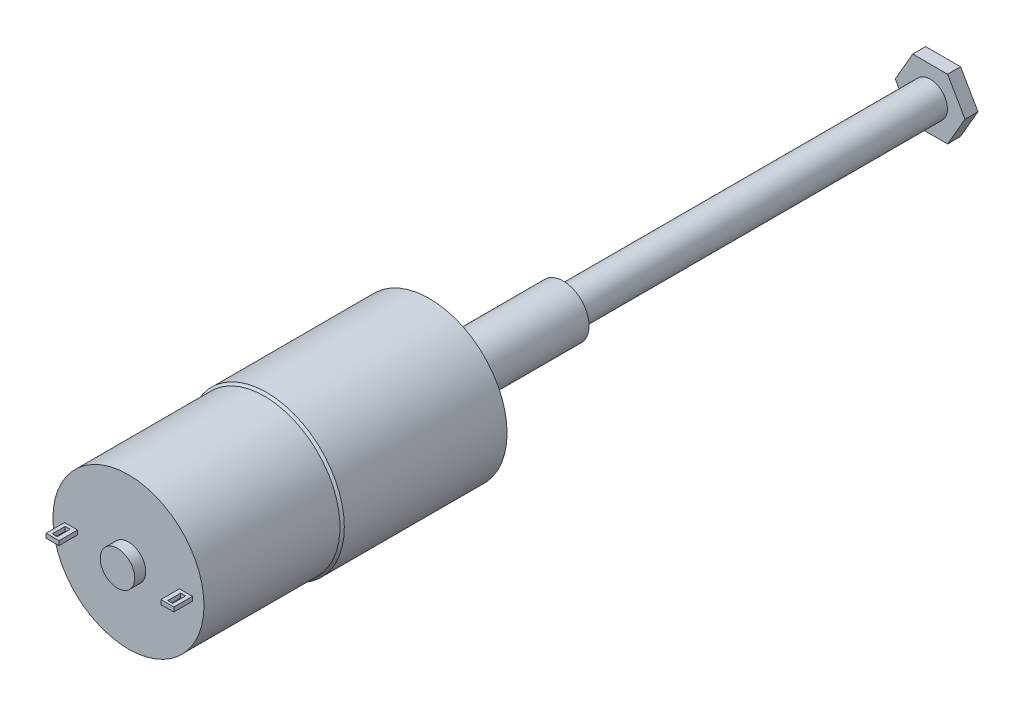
ISO-10303-21;
HEADER;
FILE_DESCRIPTION(('STEP AP214'),'2;1');
FILE_NAME('part.step','',(''),(''),'','','');
FILE_SCHEMA(('AUTOMOTIVE_DESIGN { 1 0 10303 214 1 1 1 1 }'));
ENDSEC;
DATA;
#1=APPLICATION_CONTEXT('core data for automotive mechanical design processes');
#2=APPLICATION_PROTOCOL_DEFINITION('international standard','automotive_design',2000,#1);
#3=PRODUCT_CONTEXT('',#1,'mechanical');
#4=PRODUCT('Part','Part','',(#3));
#5=PRODUCT_RELATED_PRODUCT_CATEGORY('part','',(#4));
#6=PRODUCT_DEFINITION_FORMATION('','',#4);
#7=PRODUCT_DEFINITION_CONTEXT('part definition',#1,'design');
#8=PRODUCT_DEFINITION('design','',#6,#7);
#9=PRODUCT_DEFINITION_SHAPE('','',#8);
#10=(LENGTH_UNIT() NAMED_UNIT(*) SI_UNIT(.MILLI.,.METRE.));
#11=(NAMED_UNIT(*) PLANE_ANGLE_UNIT() SI_UNIT($,.RADIAN.));
#12=(NAMED_UNIT(*) SI_UNIT($,.STERADIAN.) SOLID_ANGLE_UNIT());
#13=UNCERTAINTY_MEASURE_WITH_UNIT(LENGTH_MEASURE(1.E-05),#10,'distance_accuracy_value','');
#14=(GEOMETRIC_REPRESENTATION_CONTEXT(3) GLOBAL_UNCERTAINTY_ASSIGNED_CONTEXT((#13)) GLOBAL_UNIT_ASSIGNED_CONTEXT((#10,
#11,#12)) REPRESENTATION_CONTEXT('',''));
#15=CARTESIAN_POINT('',(0.,0.,0.));
#16=DIRECTION('',(0.,0.,1.));
#17=DIRECTION('',(1.,0.,0.));
#18=AXIS2_PLACEMENT_3D('',#15,#16,#17);
#19=CARTESIAN_POINT('',(0.,0.,-17.));
#20=DIRECTION('',(0.,0.,1.));
#21=DIRECTION('',(1.,0.,0.));
#22=AXIS2_PLACEMENT_3D('',#19,#20,#21);
#23=CYLINDRICAL_SURFACE('',#22,4.);
#24=CARTESIAN_POINT('',(0.,0.,-2.));
#25=DIRECTION('',(0.,0.,-1.));
#26=DIRECTION('',(-1.,0.,0.));
#27=AXIS2_PLACEMENT_3D('',#24,#25,#26);
#28=CIRCLE('',#27,4.);
#29=CARTESIAN_POINT('',(-4.,0.,-2.));
#30=VERTEX_POINT('',#29);
#31=EDGE_CURVE('E453',#30,#30,#28,.T.);
#32=ORIENTED_EDGE('',*,*,#31,.T.);
#33=EDGE_LOOP('',(#32));
#34=FACE_BOUND('',#33,.T.);
#35=CARTESIAN_POINT('',(0.,0.,-7.));
#36=DIRECTION('',(0.,0.,-1.));
#37=DIRECTION('',(-1.,0.,0.));
#38=AXIS2_PLACEMENT_3D('',#35,#36,#37);
#39=CIRCLE('',#38,4.);
#40=CARTESIAN_POINT('',(2.64575131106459,3.,-7.));
#41=VERTEX_POINT('',#40);
#42=CARTESIAN_POINT('',(-2.64575131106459,3.,-7.));
#43=VERTEX_POINT('',#42);
#44=EDGE_CURVE('E264',#41,#43,#39,.T.);
#45=ORIENTED_EDGE('',*,*,#44,.F.);
#46=DIRECTION('',(0.,0.,-1.));
#47=VECTOR('',#46,1.);
#48=CARTESIAN_POINT('',(2.64575131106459,3.,-5.));
#49=LINE('',#48,#47);
#50=CARTESIAN_POINT('',(2.64575131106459,3.,-5.));
#51=VERTEX_POINT('',#50);
#52=EDGE_CURVE('E462',#51,#41,#49,.T.);
#53=ORIENTED_EDGE('',*,*,#52,.F.);
#54=CARTESIAN_POINT('',(0.,0.,-5.));
#55=DIRECTION('',(0.,0.,-1.));
#56=DIRECTION('',(-1.,0.,0.));
#57=AXIS2_PLACEMENT_3D('',#54,#55,#56);
#58=CIRCLE('',#57,4.);
#59=CARTESIAN_POINT('',(-2.64575131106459,3.,-5.));
#60=VERTEX_POINT('',#59);
#61=EDGE_CURVE('E457',#60,#51,#58,.T.);
#62=ORIENTED_EDGE('',*,*,#61,.F.);
#63=DIRECTION('',(0.,0.,-1.));
#64=VECTOR('',#63,1.);
#65=CARTESIAN_POINT('',(-2.64575131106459,3.,-5.));
#66=LINE('',#65,#64);
#67=EDGE_CURVE('E461',#60,#43,#66,.T.);
#68=ORIENTED_EDGE('',*,*,#67,.T.);
#69=EDGE_LOOP('',(#45,#53,#62,#68));
#70=FACE_BOUND('',#69,.T.);
#71=ADVANCED_FACE('F55',(#34,#70),#23,.T.);
#72=CARTESIAN_POINT('',(2.64575131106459,3.,-5.));
#73=DIRECTION('',(0.,-1.,0.));
#74=DIRECTION('',(0.,0.,-1.));
#75=AXIS2_PLACEMENT_3D('',#72,#73,#74);
#76=PLANE('',#75);
#77=DIRECTION('',(1.,0.,0.));
#78=VECTOR('',#77,1.);
#79=CARTESIAN_POINT('',(2.64575131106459,3.,-7.));
#80=LINE('',#79,#78);
#81=EDGE_CURVE('E60',#43,#41,#80,.T.);
#82=ORIENTED_EDGE('',*,*,#81,.F.);
#83=ORIENTED_EDGE('',*,*,#67,.F.);
#84=DIRECTION('',(-1.,0.,0.));
#85=VECTOR('',#84,1.);
#86=CARTESIAN_POINT('',(2.64575131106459,3.,-5.));
#87=LINE('',#86,#85);
#88=EDGE_CURVE('E448',#51,#60,#87,.T.);
#89=ORIENTED_EDGE('',*,*,#88,.F.);
#90=ORIENTED_EDGE('',*,*,#52,.T.);
#91=EDGE_LOOP('',(#82,#83,#89,#90));
#92=FACE_BOUND('',#91,.T.);
#93=ADVANCED_FACE('F513',(#92),#76,.F.);
#94=CARTESIAN_POINT('',(0.,0.,69.7));
#95=DIRECTION('',(0.,0.,1.));
#96=DIRECTION('',(1.,0.,0.));
#97=AXIS2_PLACEMENT_3D('',#94,#95,#96);
#98=PLANE('',#97);
#99=CARTESIAN_POINT('',(0.,0.,69.7));
#100=DIRECTION('',(0.,0.,1.));
#101=DIRECTION('',(1.,0.,0.));
#102=AXIS2_PLACEMENT_3D('',#99,#100,#101);
#103=CIRCLE('',#102,4.);
#104=CARTESIAN_POINT('',(4.,0.,69.7));
#105=VERTEX_POINT('',#104);
#106=EDGE_CURVE('E449',#105,#105,#103,.T.);
#107=ORIENTED_EDGE('',*,*,#106,.F.);
#108=EDGE_LOOP('',(#107));
#109=FACE_BOUND('',#108,.T.);
#110=CARTESIAN_POINT('',(0.,0.,69.7));
#111=DIRECTION('',(0.,0.,1.));
#112=DIRECTION('',(1.,0.,0.));
#113=AXIS2_PLACEMENT_3D('',#110,#111,#112);
#114=CIRCLE('',#113,17.5);
#115=CARTESIAN_POINT('',(17.5,0.,69.7));
#116=VERTEX_POINT('',#115);
#117=EDGE_CURVE('E475',#116,#116,#114,.T.);
#118=ORIENTED_EDGE('',*,*,#117,.T.);
#119=EDGE_LOOP('',(#118));
#120=FACE_BOUND('',#119,.T.);
#121=DIRECTION('',(1.,0.,0.));
#122=VECTOR('',#121,1.);
#123=CARTESIAN_POINT('',(-14.8,-0.499999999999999,69.7));
#124=LINE('',#123,#122);
#125=CARTESIAN_POINT('',(-14.8,-0.499999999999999,69.7));
#126=VERTEX_POINT('',#125);
#127=CARTESIAN_POINT('',(-11.8,-0.499999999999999,69.7));
#128=VERTEX_POINT('',#127);
#129=EDGE_CURVE('E425',#126,#128,#124,.T.);
#130=ORIENTED_EDGE('',*,*,#129,.F.);
#131=DIRECTION('',(0.,-1.,0.));
#132=VECTOR('',#131,1.);
#133=CARTESIAN_POINT('',(-14.8,0.500000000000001,69.7));
#134=LINE('',#133,#132);
#135=CARTESIAN_POINT('',(-14.8,0.500000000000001,69.7));
#136=VERTEX_POINT('',#135);
#137=EDGE_CURVE('E377',#136,#126,#134,.T.);
#138=ORIENTED_EDGE('',*,*,#137,.F.);
#139=DIRECTION('',(1.,0.,0.));
#140=VECTOR('',#139,1.);
#141=CARTESIAN_POINT('',(-14.8,0.500000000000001,69.7));
#142=LINE('',#141,#140);
#143=CARTESIAN_POINT('',(-11.8,0.500000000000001,69.7));
#144=VERTEX_POINT('',#143);
#145=EDGE_CURVE('E418',#136,#144,#142,.T.);
#146=ORIENTED_EDGE('',*,*,#145,.T.);
#147=DIRECTION('',(0.,-1.,0.));
#148=VECTOR('',#147,1.);
#149=CARTESIAN_POINT('',(-11.8,0.500000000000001,69.7));
#150=LINE('',#149,#148);
#151=EDGE_CURVE('E421',#144,#128,#150,.T.);
#152=ORIENTED_EDGE('',*,*,#151,.T.);
#153=EDGE_LOOP('',(#130,#138,#146,#152));
#154=FACE_BOUND('',#153,.T.);
#155=DIRECTION('',(1.,0.,0.));
#156=VECTOR('',#155,1.);
#157=CARTESIAN_POINT('',(11.8,-0.5,69.7));
#158=LINE('',#157,#156);
#159=CARTESIAN_POINT('',(11.8,-0.5,69.7));
#160=VERTEX_POINT('',#159);
#161=CARTESIAN_POINT('',(14.8,-0.5,69.7));
#162=VERTEX_POINT('',#161);
#163=EDGE_CURVE('E376',#160,#162,#158,.T.);
#164=ORIENTED_EDGE('',*,*,#163,.F.);
#165=DIRECTION('',(0.,-1.,0.));
#166=VECTOR('',#165,1.);
#167=CARTESIAN_POINT('',(11.8,0.5,69.7));
#168=LINE('',#167,#166);
#169=CARTESIAN_POINT('',(11.8,0.5,69.7));
#170=VERTEX_POINT('',#169);
#171=EDGE_CURVE('E372',#170,#160,#168,.T.);
#172=ORIENTED_EDGE('',*,*,#171,.F.);
#173=DIRECTION('',(1.,0.,0.));
#174=VECTOR('',#173,1.);
#175=CARTESIAN_POINT('',(11.8,0.5,69.7));
#176=LINE('',#175,#174);
#177=CARTESIAN_POINT('',(14.8,0.5,69.7));
#178=VERTEX_POINT('',#177);
#179=EDGE_CURVE('E360',#170,#178,#176,.T.);
#180=ORIENTED_EDGE('',*,*,#179,.T.);
#181=DIRECTION('',(0.,-1.,0.));
#182=VECTOR('',#181,1.);
#183=CARTESIAN_POINT('',(14.8,0.5,69.7));
#184=LINE('',#183,#182);
#185=EDGE_CURVE('E381',#178,#162,#184,.T.);
#186=ORIENTED_EDGE('',*,*,#185,.T.);
#187=EDGE_LOOP('',(#164,#172,#180,#186));
#188=FACE_BOUND('',#187,.T.);
#189=ADVANCED_FACE('F520',(#109,#120,#154,#188),#98,.T.);
#190=CARTESIAN_POINT('',(0.,0.,38.7));
#191=DIRECTION('',(0.,0.,-1.));
#192=DIRECTION('',(-1.,0.,0.));
#193=AXIS2_PLACEMENT_3D('',#190,#191,#192);
#194=CYLINDRICAL_SURFACE('',#193,18.);
#195=CARTESIAN_POINT('',(0.,0.,37.7));
#196=DIRECTION('',(0.,0.,1.));
#197=DIRECTION('',(1.,0.,0.));
#198=AXIS2_PLACEMENT_3D('',#195,#196,#197);
#199=CIRCLE('',#198,18.);
#200=CARTESIAN_POINT('',(18.,0.,37.7));
#201=VERTEX_POINT('',#200);
#202=EDGE_CURVE('E487',#201,#201,#199,.F.);
#203=ORIENTED_EDGE('',*,*,#202,.T.);
#204=EDGE_LOOP('',(#203));
#205=FACE_BOUND('',#204,.T.);
#206=CARTESIAN_POINT('',(0.,0.,0.));
#207=DIRECTION('',(0.,0.,1.));
#208=DIRECTION('',(1.,0.,0.));
#209=AXIS2_PLACEMENT_3D('',#206,#207,#208);
#210=CIRCLE('',#209,18.);
#211=CARTESIAN_POINT('',(18.,0.,0.));
#212=VERTEX_POINT('',#211);
#213=EDGE_CURVE('E483',#212,#212,#210,.T.);
#214=ORIENTED_EDGE('',*,*,#213,.T.);
#215=EDGE_LOOP('',(#214));
#216=FACE_BOUND('',#215,.T.);
#217=ADVANCED_FACE('F530',(#205,#216),#194,.T.);
#218=CARTESIAN_POINT('',(0.,0.,0.));
#219=DIRECTION('',(0.,0.,1.));
#220=DIRECTION('',(1.,0.,0.));
#221=AXIS2_PLACEMENT_3D('',#218,#219,#220);
#222=PLANE('',#221);
#223=CARTESIAN_POINT('',(0.,0.,0.));
#224=DIRECTION('',(0.,0.,-1.));
#225=DIRECTION('',(-1.,0.,0.));
#226=AXIS2_PLACEMENT_3D('',#223,#224,#225);
#227=CIRCLE('',#226,11.);
#228=CARTESIAN_POINT('',(-11.,0.,0.));
#229=VERTEX_POINT('',#228);
#230=EDGE_CURVE('E471',#229,#229,#227,.T.);
#231=ORIENTED_EDGE('',*,*,#230,.F.);
#232=EDGE_LOOP('',(#231));
#233=FACE_BOUND('',#232,.T.);
#234=ORIENTED_EDGE('',*,*,#213,.F.);
#235=EDGE_LOOP('',(#234));
#236=FACE_BOUND('',#235,.T.);
#237=ADVANCED_FACE('F509',(#233,#236),#222,.F.);
#238=CARTESIAN_POINT('',(0.,0.,69.7));
#239=DIRECTION('',(0.,0.,-1.));
#240=DIRECTION('',(-1.,0.,0.));
#241=AXIS2_PLACEMENT_3D('',#238,#239,#240);
#242=CYLINDRICAL_SURFACE('',#241,17.5);
#243=CARTESIAN_POINT('',(0.,0.,38.2));
#244=DIRECTION('',(0.,0.,-1.));
#245=DIRECTION('',(-1.,0.,0.));
#246=AXIS2_PLACEMENT_3D('',#243,#244,#245);
#247=CIRCLE('',#246,17.5);
#248=CARTESIAN_POINT('',(-17.5,0.,38.2));
#249=VERTEX_POINT('',#248);
#250=EDGE_CURVE('E479',#249,#249,#247,.F.);
#251=ORIENTED_EDGE('',*,*,#250,.T.);
#252=EDGE_LOOP('',(#251));
#253=FACE_BOUND('',#252,.T.);
#254=ORIENTED_EDGE('',*,*,#117,.F.);
#255=EDGE_LOOP('',(#254));
#256=FACE_BOUND('',#255,.T.);
#257=ADVANCED_FACE('F495',(#253,#256),#242,.T.);
#258=CARTESIAN_POINT('',(0.,0.,38.7));
#259=DIRECTION('',(0.,0.,-1.));
#260=DIRECTION('',(-1.,0.,0.));
#261=AXIS2_PLACEMENT_3D('',#258,#259,#260);
#262=CONICAL_SURFACE('',#261,17.,0.785398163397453);
#263=ORIENTED_EDGE('',*,*,#202,.F.);
#264=EDGE_LOOP('',(#263));
#265=FACE_BOUND('',#264,.T.);
#266=ORIENTED_EDGE('',*,*,#250,.F.);
#267=EDGE_LOOP('',(#266));
#268=FACE_BOUND('',#267,.T.);
#269=ADVANCED_FACE('F58',(#265,#268),#262,.T.);
#270=CARTESIAN_POINT('',(0.,0.,-2.));
#271=DIRECTION('',(0.,0.,1.));
#272=DIRECTION('',(1.,0.,0.));
#273=AXIS2_PLACEMENT_3D('',#270,#271,#272);
#274=CYLINDRICAL_SURFACE('',#273,11.);
#275=CARTESIAN_POINT('',(0.,0.,-2.));
#276=DIRECTION('',(0.,0.,-1.));
#277=DIRECTION('',(-1.,0.,0.));
#278=AXIS2_PLACEMENT_3D('',#275,#276,#277);
#279=CIRCLE('',#278,11.);
#280=CARTESIAN_POINT('',(-11.,0.,-2.));
#281=VERTEX_POINT('',#280);
#282=EDGE_CURVE('E465',#281,#281,#279,.T.);
#283=ORIENTED_EDGE('',*,*,#282,.F.);
#284=EDGE_LOOP('',(#283));
#285=FACE_BOUND('',#284,.T.);
#286=ORIENTED_EDGE('',*,*,#230,.T.);
#287=EDGE_LOOP('',(#286));
#288=FACE_BOUND('',#287,.T.);
#289=ADVANCED_FACE('F499',(#285,#288),#274,.T.);
#290=CARTESIAN_POINT('',(0.,0.,-2.));
#291=DIRECTION('',(0.,0.,-1.));
#292=DIRECTION('',(-1.,0.,0.));
#293=AXIS2_PLACEMENT_3D('',#290,#291,#292);
#294=PLANE('',#293);
#295=ORIENTED_EDGE('',*,*,#31,.F.);
#296=EDGE_LOOP('',(#295));
#297=FACE_BOUND('',#296,.T.);
#298=ORIENTED_EDGE('',*,*,#282,.T.);
#299=EDGE_LOOP('',(#298));
#300=FACE_BOUND('',#299,.T.);
#301=ADVANCED_FACE('F505',(#297,#300),#294,.T.);
#302=CARTESIAN_POINT('',(0.,0.,-5.));
#303=DIRECTION('',(0.,0.,-1.));
#304=DIRECTION('',(-1.,0.,0.));
#305=AXIS2_PLACEMENT_3D('',#302,#303,#304);
#306=PLANE('',#305);
#307=ORIENTED_EDGE('',*,*,#88,.T.);
#308=ORIENTED_EDGE('',*,*,#61,.T.);
#309=EDGE_LOOP('',(#307,#308));
#310=FACE_BOUND('',#309,.T.);
#311=ADVANCED_FACE('F526',(#310),#306,.T.);
#312=CARTESIAN_POINT('',(0.,0.,72.24));
#313=DIRECTION('',(0.,0.,-1.));
#314=DIRECTION('',(-1.,0.,0.));
#315=AXIS2_PLACEMENT_3D('',#312,#313,#314);
#316=CYLINDRICAL_SURFACE('',#315,4.);
#317=CARTESIAN_POINT('',(0.,0.,72.24));
#318=DIRECTION('',(0.,0.,1.));
#319=DIRECTION('',(1.,0.,0.));
#320=AXIS2_PLACEMENT_3D('',#317,#318,#319);
#321=CIRCLE('',#320,4.);
#322=CARTESIAN_POINT('',(4.,0.,72.24));
#323=VERTEX_POINT('',#322);
#324=EDGE_CURVE('E401',#323,#323,#321,.T.);
#325=ORIENTED_EDGE('',*,*,#324,.F.);
#326=EDGE_LOOP('',(#325));
#327=FACE_BOUND('',#326,.T.);
#328=ORIENTED_EDGE('',*,*,#106,.T.);
#329=EDGE_LOOP('',(#328));
#330=FACE_BOUND('',#329,.T.);
#331=ADVANCED_FACE('F898',(#327,#330),#316,.T.);
#332=CARTESIAN_POINT('',(0.,0.,72.24));
#333=DIRECTION('',(0.,0.,1.));
#334=DIRECTION('',(1.,0.,0.));
#335=AXIS2_PLACEMENT_3D('',#332,#333,#334);
#336=PLANE('',#335);
#337=ORIENTED_EDGE('',*,*,#324,.T.);
#338=EDGE_LOOP('',(#337));
#339=FACE_BOUND('',#338,.T.);
#340=ADVANCED_FACE('F566',(#339),#336,.T.);
#341=CARTESIAN_POINT('',(-14.8,0.500000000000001,74.));
#342=DIRECTION('',(1.,0.,0.));
#343=DIRECTION('',(0.,0.,-1.));
#344=AXIS2_PLACEMENT_3D('',#341,#342,#343);
#345=PLANE('',#344);
#346=ORIENTED_EDGE('',*,*,#137,.T.);
#347=DIRECTION('',(0.,0.,-1.));
#348=VECTOR('',#347,1.);
#349=CARTESIAN_POINT('',(-14.8,-0.499999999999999,74.));
#350=LINE('',#349,#348);
#351=CARTESIAN_POINT('',(-14.8,-0.499999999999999,74.));
#352=VERTEX_POINT('',#351);
#353=EDGE_CURVE('E354',#352,#126,#350,.T.);
#354=ORIENTED_EDGE('',*,*,#353,.F.);
#355=DIRECTION('',(0.,-1.,0.));
#356=VECTOR('',#355,1.);
#357=CARTESIAN_POINT('',(-14.8,0.500000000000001,74.));
#358=LINE('',#357,#356);
#359=CARTESIAN_POINT('',(-14.8,0.500000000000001,74.));
#360=VERTEX_POINT('',#359);
#361=EDGE_CURVE('E422',#360,#352,#358,.T.);
#362=ORIENTED_EDGE('',*,*,#361,.F.);
#363=DIRECTION('',(0.,0.,-1.));
#364=VECTOR('',#363,1.);
#365=CARTESIAN_POINT('',(-14.8,0.500000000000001,74.));
#366=LINE('',#365,#364);
#367=EDGE_CURVE('E413',#360,#136,#366,.T.);
#368=ORIENTED_EDGE('',*,*,#367,.T.);
#369=EDGE_LOOP('',(#346,#354,#362,#368));
#370=FACE_BOUND('',#369,.T.);
#371=ADVANCED_FACE('F562',(#370),#345,.F.);
#372=CARTESIAN_POINT('',(-14.8,-0.499999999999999,74.));
#373=DIRECTION('',(0.,1.,0.));
#374=DIRECTION('',(0.,0.,1.));
#375=AXIS2_PLACEMENT_3D('',#372,#373,#374);
#376=PLANE('',#375);
#377=DIRECTION('',(1.,0.,0.));
#378=VECTOR('',#377,1.);
#379=CARTESIAN_POINT('',(-14.8,-0.499999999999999,73.4));
#380=LINE('',#379,#378);
#381=CARTESIAN_POINT('',(-13.9628480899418,-0.5,73.4));
#382=VERTEX_POINT('',#381);
#383=CARTESIAN_POINT('',(-12.8,-0.5,73.4));
#384=VERTEX_POINT('',#383);
#385=EDGE_CURVE('E346',#382,#384,#380,.T.);
#386=ORIENTED_EDGE('',*,*,#385,.T.);
#387=DIRECTION('',(0.,0.,-1.));
#388=VECTOR('',#387,1.);
#389=CARTESIAN_POINT('',(-12.8,-0.499999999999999,74.));
#390=LINE('',#389,#388);
#391=CARTESIAN_POINT('',(-12.8,-0.5,70.4));
#392=VERTEX_POINT('',#391);
#393=EDGE_CURVE('E350',#384,#392,#390,.T.);
#394=ORIENTED_EDGE('',*,*,#393,.T.);
#395=DIRECTION('',(-1.,0.,0.));
#396=VECTOR('',#395,1.);
#397=CARTESIAN_POINT('',(-14.8,-0.499999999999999,70.4));
#398=LINE('',#397,#396);
#399=CARTESIAN_POINT('',(-13.9628480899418,-0.499999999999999,70.4));
#400=VERTEX_POINT('',#399);
#401=EDGE_CURVE('E338',#392,#400,#398,.T.);
#402=ORIENTED_EDGE('',*,*,#401,.T.);
#403=DIRECTION('',(0.,0.,1.));
#404=VECTOR('',#403,1.);
#405=CARTESIAN_POINT('',(-13.9628480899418,-0.499999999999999,74.));
#406=LINE('',#405,#404);
#407=EDGE_CURVE('E342',#400,#382,#406,.T.);
#408=ORIENTED_EDGE('',*,*,#407,.T.);
#409=EDGE_LOOP('',(#386,#394,#402,#408));
#410=FACE_BOUND('',#409,.T.);
#411=ORIENTED_EDGE('',*,*,#129,.T.);
#412=DIRECTION('',(0.,0.,-1.));
#413=VECTOR('',#412,1.);
#414=CARTESIAN_POINT('',(-11.8,-0.499999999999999,74.));
#415=LINE('',#414,#413);
#416=CARTESIAN_POINT('',(-11.8,-0.499999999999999,74.));
#417=VERTEX_POINT('',#416);
#418=EDGE_CURVE('E405',#417,#128,#415,.T.);
#419=ORIENTED_EDGE('',*,*,#418,.F.);
#420=DIRECTION('',(1.,0.,0.));
#421=VECTOR('',#420,1.);
#422=CARTESIAN_POINT('',(-14.8,-0.499999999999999,74.));
#423=LINE('',#422,#421);
#424=EDGE_CURVE('E439',#352,#417,#423,.T.);
#425=ORIENTED_EDGE('',*,*,#424,.F.);
#426=ORIENTED_EDGE('',*,*,#353,.T.);
#427=EDGE_LOOP('',(#411,#419,#425,#426));
#428=FACE_BOUND('',#427,.T.);
#429=ADVANCED_FACE('F565',(#410,#428),#376,.F.);
#430=CARTESIAN_POINT('',(-11.8,0.500000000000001,74.));
#431=DIRECTION('',(1.,0.,0.));
#432=DIRECTION('',(0.,0.,-1.));
#433=AXIS2_PLACEMENT_3D('',#430,#431,#432);
#434=PLANE('',#433);
#435=ORIENTED_EDGE('',*,*,#151,.F.);
#436=DIRECTION('',(0.,0.,-1.));
#437=VECTOR('',#436,1.);
#438=CARTESIAN_POINT('',(-11.8,0.500000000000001,74.));
#439=LINE('',#438,#437);
#440=CARTESIAN_POINT('',(-11.8,0.500000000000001,74.));
#441=VERTEX_POINT('',#440);
#442=EDGE_CURVE('E409',#441,#144,#439,.T.);
#443=ORIENTED_EDGE('',*,*,#442,.F.);
#444=DIRECTION('',(0.,-1.,0.));
#445=VECTOR('',#444,1.);
#446=CARTESIAN_POINT('',(-11.8,0.500000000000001,74.));
#447=LINE('',#446,#445);
#448=EDGE_CURVE('E435',#441,#417,#447,.T.);
#449=ORIENTED_EDGE('',*,*,#448,.T.);
#450=ORIENTED_EDGE('',*,*,#418,.T.);
#451=EDGE_LOOP('',(#435,#443,#449,#450));
#452=FACE_BOUND('',#451,.T.);
#453=ADVANCED_FACE('F574',(#452),#434,.T.);
#454=CARTESIAN_POINT('',(-14.8,0.500000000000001,74.));
#455=DIRECTION('',(0.,1.,0.));
#456=DIRECTION('',(0.,0.,1.));
#457=AXIS2_PLACEMENT_3D('',#454,#455,#456);
#458=PLANE('',#457);
#459=DIRECTION('',(0.,0.,-1.));
#460=VECTOR('',#459,1.);
#461=CARTESIAN_POINT('',(-12.8,0.5,70.4));
#462=LINE('',#461,#460);
#463=CARTESIAN_POINT('',(-12.8,0.5,73.4));
#464=VERTEX_POINT('',#463);
#465=CARTESIAN_POINT('',(-12.8,0.500000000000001,70.4));
#466=VERTEX_POINT('',#465);
#467=EDGE_CURVE('E273',#464,#466,#462,.T.);
#468=ORIENTED_EDGE('',*,*,#467,.F.);
#469=DIRECTION('',(1.,0.,0.));
#470=VECTOR('',#469,1.);
#471=CARTESIAN_POINT('',(-13.9628480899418,0.5,73.4));
#472=LINE('',#471,#470);
#473=CARTESIAN_POINT('',(-13.9628480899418,0.5,73.4));
#474=VERTEX_POINT('',#473);
#475=EDGE_CURVE('E303',#474,#464,#472,.T.);
#476=ORIENTED_EDGE('',*,*,#475,.F.);
#477=DIRECTION('',(0.,0.,1.));
#478=VECTOR('',#477,1.);
#479=CARTESIAN_POINT('',(-13.9628480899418,0.5,70.4));
#480=LINE('',#479,#478);
#481=CARTESIAN_POINT('',(-13.9628480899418,0.5,70.4));
#482=VERTEX_POINT('',#481);
#483=EDGE_CURVE('E314',#482,#474,#480,.T.);
#484=ORIENTED_EDGE('',*,*,#483,.F.);
#485=DIRECTION('',(-1.,0.,0.));
#486=VECTOR('',#485,1.);
#487=CARTESIAN_POINT('',(-13.9628480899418,0.5,70.4));
#488=LINE('',#487,#486);
#489=EDGE_CURVE('E318',#466,#482,#488,.T.);
#490=ORIENTED_EDGE('',*,*,#489,.F.);
#491=EDGE_LOOP('',(#468,#476,#484,#490));
#492=FACE_BOUND('',#491,.T.);
#493=ORIENTED_EDGE('',*,*,#145,.F.);
#494=ORIENTED_EDGE('',*,*,#367,.F.);
#495=DIRECTION('',(1.,0.,0.));
#496=VECTOR('',#495,1.);
#497=CARTESIAN_POINT('',(-14.8,0.500000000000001,74.));
#498=LINE('',#497,#496);
#499=EDGE_CURVE('E417',#360,#441,#498,.T.);
#500=ORIENTED_EDGE('',*,*,#499,.T.);
#501=ORIENTED_EDGE('',*,*,#442,.T.);
#502=EDGE_LOOP('',(#493,#494,#500,#501));
#503=FACE_BOUND('',#502,.T.);
#504=ADVANCED_FACE('F582',(#492,#503),#458,.T.);
#505=CARTESIAN_POINT('',(0.,0.,74.));
#506=DIRECTION('',(0.,0.,1.));
#507=DIRECTION('',(1.,0.,0.));
#508=AXIS2_PLACEMENT_3D('',#505,#506,#507);
#509=PLANE('',#508);
#510=ORIENTED_EDGE('',*,*,#361,.T.);
#511=ORIENTED_EDGE('',*,*,#424,.T.);
#512=ORIENTED_EDGE('',*,*,#448,.F.);
#513=ORIENTED_EDGE('',*,*,#499,.F.);
#514=EDGE_LOOP('',(#510,#511,#512,#513));
#515=FACE_BOUND('',#514,.T.);
#516=ADVANCED_FACE('F590',(#515),#509,.T.);
#517=CARTESIAN_POINT('',(11.8,0.5,74.));
#518=DIRECTION('',(1.,0.,0.));
#519=DIRECTION('',(0.,0.,-1.));
#520=AXIS2_PLACEMENT_3D('',#517,#518,#519);
#521=PLANE('',#520);
#522=ORIENTED_EDGE('',*,*,#171,.T.);
#523=DIRECTION('',(0.,0.,-1.));
#524=VECTOR('',#523,1.);
#525=CARTESIAN_POINT('',(11.8,-0.5,74.));
#526=LINE('',#525,#524);
#527=CARTESIAN_POINT('',(11.8,-0.5,74.));
#528=VERTEX_POINT('',#527);
#529=EDGE_CURVE('E397',#528,#160,#526,.T.);
#530=ORIENTED_EDGE('',*,*,#529,.F.);
#531=DIRECTION('',(0.,-1.,0.));
#532=VECTOR('',#531,1.);
#533=CARTESIAN_POINT('',(11.8,0.5,74.));
#534=LINE('',#533,#532);
#535=CARTESIAN_POINT('',(11.8,0.5,74.));
#536=VERTEX_POINT('',#535);
#537=EDGE_CURVE('E355',#536,#528,#534,.T.);
#538=ORIENTED_EDGE('',*,*,#537,.F.);
#539=DIRECTION('',(0.,0.,-1.));
#540=VECTOR('',#539,1.);
#541=CARTESIAN_POINT('',(11.8,0.5,74.));
#542=LINE('',#541,#540);
#543=EDGE_CURVE('E371',#536,#170,#542,.T.);
#544=ORIENTED_EDGE('',*,*,#543,.T.);
#545=EDGE_LOOP('',(#522,#530,#538,#544));
#546=FACE_BOUND('',#545,.T.);
#547=ADVANCED_FACE('F598',(#546),#521,.F.);
#548=CARTESIAN_POINT('',(11.8,-0.5,74.));
#549=DIRECTION('',(0.,1.,0.));
#550=DIRECTION('',(-1.,0.,0.));
#551=AXIS2_PLACEMENT_3D('',#548,#549,#550);
#552=PLANE('',#551);
#553=DIRECTION('',(1.,0.,0.));
#554=VECTOR('',#553,1.);
#555=CARTESIAN_POINT('',(11.8,-0.5,73.4));
#556=LINE('',#555,#554);
#557=CARTESIAN_POINT('',(12.8,-0.500000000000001,73.4));
#558=VERTEX_POINT('',#557);
#559=CARTESIAN_POINT('',(13.9428776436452,-0.500000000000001,73.4));
#560=VERTEX_POINT('',#559);
#561=EDGE_CURVE('E330',#558,#560,#556,.T.);
#562=ORIENTED_EDGE('',*,*,#561,.T.);
#563=DIRECTION('',(0.,0.,-1.));
#564=VECTOR('',#563,1.);
#565=CARTESIAN_POINT('',(13.9428776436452,-0.5,74.));
#566=LINE('',#565,#564);
#567=CARTESIAN_POINT('',(13.9428776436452,-0.500000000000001,70.4));
#568=VERTEX_POINT('',#567);
#569=EDGE_CURVE('E334',#560,#568,#566,.T.);
#570=ORIENTED_EDGE('',*,*,#569,.T.);
#571=DIRECTION('',(-1.,0.,0.));
#572=VECTOR('',#571,1.);
#573=CARTESIAN_POINT('',(11.8,-0.5,70.4));
#574=LINE('',#573,#572);
#575=CARTESIAN_POINT('',(12.8,-0.5,70.4));
#576=VERTEX_POINT('',#575);
#577=EDGE_CURVE('E289',#568,#576,#574,.T.);
#578=ORIENTED_EDGE('',*,*,#577,.T.);
#579=DIRECTION('',(0.,0.,1.));
#580=VECTOR('',#579,1.);
#581=CARTESIAN_POINT('',(12.8,-0.5,74.));
#582=LINE('',#581,#580);
#583=EDGE_CURVE('E326',#576,#558,#582,.T.);
#584=ORIENTED_EDGE('',*,*,#583,.T.);
#585=EDGE_LOOP('',(#562,#570,#578,#584));
#586=FACE_BOUND('',#585,.T.);
#587=ORIENTED_EDGE('',*,*,#163,.T.);
#588=DIRECTION('',(0.,0.,-1.));
#589=VECTOR('',#588,1.);
#590=CARTESIAN_POINT('',(14.8,-0.5,74.));
#591=LINE('',#590,#589);
#592=CARTESIAN_POINT('',(14.8,-0.5,74.));
#593=VERTEX_POINT('',#592);
#594=EDGE_CURVE('E393',#593,#162,#591,.T.);
#595=ORIENTED_EDGE('',*,*,#594,.F.);
#596=DIRECTION('',(1.,0.,0.));
#597=VECTOR('',#596,1.);
#598=CARTESIAN_POINT('',(11.8,-0.5,74.));
#599=LINE('',#598,#597);
#600=EDGE_CURVE('E359',#528,#593,#599,.T.);
#601=ORIENTED_EDGE('',*,*,#600,.F.);
#602=ORIENTED_EDGE('',*,*,#529,.T.);
#603=EDGE_LOOP('',(#587,#595,#601,#602));
#604=FACE_BOUND('',#603,.T.);
#605=ADVANCED_FACE('F606',(#586,#604),#552,.F.);
#606=CARTESIAN_POINT('',(14.8,0.5,74.));
#607=DIRECTION('',(1.,0.,0.));
#608=DIRECTION('',(0.,0.,-1.));
#609=AXIS2_PLACEMENT_3D('',#606,#607,#608);
#610=PLANE('',#609);
#611=ORIENTED_EDGE('',*,*,#185,.F.);
#612=DIRECTION('',(0.,0.,-1.));
#613=VECTOR('',#612,1.);
#614=CARTESIAN_POINT('',(14.8,0.5,74.));
#615=LINE('',#614,#613);
#616=CARTESIAN_POINT('',(14.8,0.5,74.));
#617=VERTEX_POINT('',#616);
#618=EDGE_CURVE('E389',#617,#178,#615,.T.);
#619=ORIENTED_EDGE('',*,*,#618,.F.);
#620=DIRECTION('',(0.,-1.,0.));
#621=VECTOR('',#620,1.);
#622=CARTESIAN_POINT('',(14.8,0.5,74.));
#623=LINE('',#622,#621);
#624=EDGE_CURVE('E363',#617,#593,#623,.T.);
#625=ORIENTED_EDGE('',*,*,#624,.T.);
#626=ORIENTED_EDGE('',*,*,#594,.T.);
#627=EDGE_LOOP('',(#611,#619,#625,#626));
#628=FACE_BOUND('',#627,.T.);
#629=ADVANCED_FACE('F614',(#628),#610,.T.);
#630=CARTESIAN_POINT('',(11.8,0.5,74.));
#631=DIRECTION('',(0.,1.,0.));
#632=DIRECTION('',(0.,0.,1.));
#633=AXIS2_PLACEMENT_3D('',#630,#631,#632);
#634=PLANE('',#633);
#635=DIRECTION('',(0.,0.,-1.));
#636=VECTOR('',#635,1.);
#637=CARTESIAN_POINT('',(13.9428776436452,0.5,73.4));
#638=LINE('',#637,#636);
#639=CARTESIAN_POINT('',(13.9428776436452,0.5,73.4));
#640=VERTEX_POINT('',#639);
#641=CARTESIAN_POINT('',(13.9428776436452,0.5,70.4));
#642=VERTEX_POINT('',#641);
#643=EDGE_CURVE('E269',#640,#642,#638,.T.);
#644=ORIENTED_EDGE('',*,*,#643,.F.);
#645=DIRECTION('',(1.,0.,0.));
#646=VECTOR('',#645,1.);
#647=CARTESIAN_POINT('',(12.8,0.5,73.4));
#648=LINE('',#647,#646);
#649=CARTESIAN_POINT('',(12.8,0.5,73.4));
#650=VERTEX_POINT('',#649);
#651=EDGE_CURVE('E281',#650,#640,#648,.T.);
#652=ORIENTED_EDGE('',*,*,#651,.F.);
#653=DIRECTION('',(0.,0.,1.));
#654=VECTOR('',#653,1.);
#655=CARTESIAN_POINT('',(12.8,0.5,73.4));
#656=LINE('',#655,#654);
#657=CARTESIAN_POINT('',(12.8,0.5,70.4));
#658=VERTEX_POINT('',#657);
#659=EDGE_CURVE('E277',#658,#650,#656,.T.);
#660=ORIENTED_EDGE('',*,*,#659,.F.);
#661=DIRECTION('',(-1.,0.,0.));
#662=VECTOR('',#661,1.);
#663=CARTESIAN_POINT('',(12.8,0.5,70.4));
#664=LINE('',#663,#662);
#665=EDGE_CURVE('E272',#642,#658,#664,.T.);
#666=ORIENTED_EDGE('',*,*,#665,.F.);
#667=EDGE_LOOP('',(#644,#652,#660,#666));
#668=FACE_BOUND('',#667,.T.);
#669=ORIENTED_EDGE('',*,*,#179,.F.);
#670=ORIENTED_EDGE('',*,*,#543,.F.);
#671=DIRECTION('',(1.,0.,0.));
#672=VECTOR('',#671,1.);
#673=CARTESIAN_POINT('',(11.8,0.5,74.));
#674=LINE('',#673,#672);
#675=EDGE_CURVE('E367',#536,#617,#674,.T.);
#676=ORIENTED_EDGE('',*,*,#675,.T.);
#677=ORIENTED_EDGE('',*,*,#618,.T.);
#678=EDGE_LOOP('',(#669,#670,#676,#677));
#679=FACE_BOUND('',#678,.T.);
#680=ADVANCED_FACE('F622',(#668,#679),#634,.T.);
#681=CARTESIAN_POINT('',(0.,0.,74.));
#682=DIRECTION('',(0.,0.,1.));
#683=DIRECTION('',(1.,0.,0.));
#684=AXIS2_PLACEMENT_3D('',#681,#682,#683);
#685=PLANE('',#684);
#686=ORIENTED_EDGE('',*,*,#537,.T.);
#687=ORIENTED_EDGE('',*,*,#600,.T.);
#688=ORIENTED_EDGE('',*,*,#624,.F.);
#689=ORIENTED_EDGE('',*,*,#675,.F.);
#690=EDGE_LOOP('',(#686,#687,#688,#689));
#691=FACE_BOUND('',#690,.T.);
#692=ADVANCED_FACE('F630',(#691),#685,.T.);
#693=CARTESIAN_POINT('',(13.9428776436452,-3.8,73.4));
#694=DIRECTION('',(1.,0.,0.));
#695=DIRECTION('',(0.,0.,-1.));
#696=AXIS2_PLACEMENT_3D('',#693,#694,#695);
#697=PLANE('',#696);
#698=DIRECTION('',(0.,1.,0.));
#699=VECTOR('',#698,1.);
#700=CARTESIAN_POINT('',(13.9428776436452,-3.8,73.4));
#701=LINE('',#700,#699);
#702=EDGE_CURVE('E286',#560,#640,#701,.T.);
#703=ORIENTED_EDGE('',*,*,#702,.T.);
#704=ORIENTED_EDGE('',*,*,#643,.T.);
#705=DIRECTION('',(0.,1.,0.));
#706=VECTOR('',#705,1.);
#707=CARTESIAN_POINT('',(13.9428776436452,-3.8,70.4));
#708=LINE('',#707,#706);
#709=EDGE_CURVE('E285',#568,#642,#708,.T.);
#710=ORIENTED_EDGE('',*,*,#709,.F.);
#711=ORIENTED_EDGE('',*,*,#569,.F.);
#712=EDGE_LOOP('',(#703,#704,#710,#711));
#713=FACE_BOUND('',#712,.T.);
#714=ADVANCED_FACE('F638',(#713),#697,.F.);
#715=CARTESIAN_POINT('',(12.8,-3.8,73.4));
#716=DIRECTION('',(0.,0.,1.));
#717=DIRECTION('',(1.,0.,0.));
#718=AXIS2_PLACEMENT_3D('',#715,#716,#717);
#719=PLANE('',#718);
#720=DIRECTION('',(0.,1.,0.));
#721=VECTOR('',#720,1.);
#722=CARTESIAN_POINT('',(12.8,-3.8,73.4));
#723=LINE('',#722,#721);
#724=EDGE_CURVE('E290',#558,#650,#723,.T.);
#725=ORIENTED_EDGE('',*,*,#724,.T.);
#726=ORIENTED_EDGE('',*,*,#651,.T.);
#727=ORIENTED_EDGE('',*,*,#702,.F.);
#728=ORIENTED_EDGE('',*,*,#561,.F.);
#729=EDGE_LOOP('',(#725,#726,#727,#728));
#730=FACE_BOUND('',#729,.T.);
#731=ADVANCED_FACE('F848',(#730),#719,.F.);
#732=CARTESIAN_POINT('',(12.8,-3.8,73.4));
#733=DIRECTION('',(-1.,0.,0.));
#734=DIRECTION('',(0.,0.,1.));
#735=AXIS2_PLACEMENT_3D('',#732,#733,#734);
#736=PLANE('',#735);
#737=DIRECTION('',(0.,1.,0.));
#738=VECTOR('',#737,1.);
#739=CARTESIAN_POINT('',(12.8,-3.8,70.4));
#740=LINE('',#739,#738);
#741=EDGE_CURVE('E293',#576,#658,#740,.T.);
#742=ORIENTED_EDGE('',*,*,#741,.T.);
#743=ORIENTED_EDGE('',*,*,#659,.T.);
#744=ORIENTED_EDGE('',*,*,#724,.F.);
#745=ORIENTED_EDGE('',*,*,#583,.F.);
#746=EDGE_LOOP('',(#742,#743,#744,#745));
#747=FACE_BOUND('',#746,.T.);
#748=ADVANCED_FACE('F841',(#747),#736,.F.);
#749=CARTESIAN_POINT('',(12.8,-3.8,70.4));
#750=DIRECTION('',(0.,0.,-1.));
#751=DIRECTION('',(-1.,0.,0.));
#752=AXIS2_PLACEMENT_3D('',#749,#750,#751);
#753=PLANE('',#752);
#754=ORIENTED_EDGE('',*,*,#709,.T.);
#755=ORIENTED_EDGE('',*,*,#665,.T.);
#756=ORIENTED_EDGE('',*,*,#741,.F.);
#757=ORIENTED_EDGE('',*,*,#577,.F.);
#758=EDGE_LOOP('',(#754,#755,#756,#757));
#759=FACE_BOUND('',#758,.T.);
#760=ADVANCED_FACE('F834',(#759),#753,.F.);
#761=CARTESIAN_POINT('',(-12.8,-3.8,70.4));
#762=DIRECTION('',(1.,0.,0.));
#763=DIRECTION('',(0.,0.,-1.));
#764=AXIS2_PLACEMENT_3D('',#761,#762,#763);
#765=PLANE('',#764);
#766=DIRECTION('',(0.,1.,0.));
#767=VECTOR('',#766,1.);
#768=CARTESIAN_POINT('',(-12.8,-3.8,73.4));
#769=LINE('',#768,#767);
#770=EDGE_CURVE('E268',#384,#464,#769,.T.);
#771=ORIENTED_EDGE('',*,*,#770,.T.);
#772=ORIENTED_EDGE('',*,*,#467,.T.);
#773=DIRECTION('',(0.,1.,0.));
#774=VECTOR('',#773,1.);
#775=CARTESIAN_POINT('',(-12.8,-3.8,70.4));
#776=LINE('',#775,#774);
#777=EDGE_CURVE('E299',#392,#466,#776,.T.);
#778=ORIENTED_EDGE('',*,*,#777,.F.);
#779=ORIENTED_EDGE('',*,*,#393,.F.);
#780=EDGE_LOOP('',(#771,#772,#778,#779));
#781=FACE_BOUND('',#780,.T.);
#782=ADVANCED_FACE('F827',(#781),#765,.F.);
#783=CARTESIAN_POINT('',(-13.9628480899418,-3.8,73.4));
#784=DIRECTION('',(0.,0.,1.));
#785=DIRECTION('',(1.,0.,0.));
#786=AXIS2_PLACEMENT_3D('',#783,#784,#785);
#787=PLANE('',#786);
#788=DIRECTION('',(0.,1.,0.));
#789=VECTOR('',#788,1.);
#790=CARTESIAN_POINT('',(-13.9628480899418,-3.8,73.4));
#791=LINE('',#790,#789);
#792=EDGE_CURVE('E306',#382,#474,#791,.T.);
#793=ORIENTED_EDGE('',*,*,#792,.T.);
#794=ORIENTED_EDGE('',*,*,#475,.T.);
#795=ORIENTED_EDGE('',*,*,#770,.F.);
#796=ORIENTED_EDGE('',*,*,#385,.F.);
#797=EDGE_LOOP('',(#793,#794,#795,#796));
#798=FACE_BOUND('',#797,.T.);
#799=ADVANCED_FACE('F820',(#798),#787,.F.);
#800=CARTESIAN_POINT('',(-13.9628480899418,-3.8,70.4));
#801=DIRECTION('',(-1.,0.,0.));
#802=DIRECTION('',(0.,0.,1.));
#803=AXIS2_PLACEMENT_3D('',#800,#801,#802);
#804=PLANE('',#803);
#805=DIRECTION('',(0.,1.,0.));
#806=VECTOR('',#805,1.);
#807=CARTESIAN_POINT('',(-13.9628480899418,-3.8,70.4));
#808=LINE('',#807,#806);
#809=EDGE_CURVE('E80',#400,#482,#808,.T.);
#810=ORIENTED_EDGE('',*,*,#809,.T.);
#811=ORIENTED_EDGE('',*,*,#483,.T.);
#812=ORIENTED_EDGE('',*,*,#792,.F.);
#813=ORIENTED_EDGE('',*,*,#407,.F.);
#814=EDGE_LOOP('',(#810,#811,#812,#813));
#815=FACE_BOUND('',#814,.T.);
#816=ADVANCED_FACE('F815',(#815),#804,.F.);
#817=CARTESIAN_POINT('',(-13.9628480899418,-3.8,70.4));
#818=DIRECTION('',(0.,0.,-1.));
#819=DIRECTION('',(-1.,0.,0.));
#820=AXIS2_PLACEMENT_3D('',#817,#818,#819);
#821=PLANE('',#820);
#822=ORIENTED_EDGE('',*,*,#777,.T.);
#823=ORIENTED_EDGE('',*,*,#489,.T.);
#824=ORIENTED_EDGE('',*,*,#809,.F.);
#825=ORIENTED_EDGE('',*,*,#401,.F.);
#826=EDGE_LOOP('',(#822,#823,#824,#825));
#827=FACE_BOUND('',#826,.T.);
#828=ADVANCED_FACE('F780',(#827),#821,.F.);
#829=CARTESIAN_POINT('',(0.,0.,-7.));
#830=DIRECTION('',(0.,0.,-1.));
#831=DIRECTION('',(-1.,0.,0.));
#832=AXIS2_PLACEMENT_3D('',#829,#830,#831);
#833=PLANE('',#832);
#834=CARTESIAN_POINT('',(0.,0.,-7.));
#835=DIRECTION('',(0.,0.,-1.));
#836=DIRECTION('',(-1.,0.,0.));
#837=AXIS2_PLACEMENT_3D('',#834,#835,#836);
#838=CIRCLE('',#837,6.);
#839=CARTESIAN_POINT('',(-6.,0.,-7.));
#840=VERTEX_POINT('',#839);
#841=EDGE_CURVE('E260',#840,#840,#838,.T.);
#842=ORIENTED_EDGE('',*,*,#841,.F.);
#843=EDGE_LOOP('',(#842));
#844=FACE_BOUND('',#843,.T.);
#845=ORIENTED_EDGE('',*,*,#81,.T.);
#846=ORIENTED_EDGE('',*,*,#44,.T.);
#847=EDGE_LOOP('',(#845,#846));
#848=FACE_BOUND('',#847,.T.);
#849=ADVANCED_FACE('F772',(#844,#848),#833,.F.);
#850=CARTESIAN_POINT('',(0.,0.,-7.));
#851=DIRECTION('',(0.,0.,-1.));
#852=DIRECTION('',(-1.,0.,0.));
#853=AXIS2_PLACEMENT_3D('',#850,#851,#852);
#854=CYLINDRICAL_SURFACE('',#853,6.);
#855=ORIENTED_EDGE('',*,*,#841,.T.);
#856=EDGE_LOOP('',(#855));
#857=FACE_BOUND('',#856,.T.);
#858=CARTESIAN_POINT('',(0.,0.,-31.));
#859=DIRECTION('',(0.,0.,-1.));
#860=DIRECTION('',(-1.,0.,0.));
#861=AXIS2_PLACEMENT_3D('',#858,#859,#860);
#862=CIRCLE('',#861,6.);
#863=CARTESIAN_POINT('',(-6.,0.,-31.));
#864=VERTEX_POINT('',#863);
#865=EDGE_CURVE('E251',#864,#864,#862,.T.);
#866=ORIENTED_EDGE('',*,*,#865,.F.);
#867=EDGE_LOOP('',(#866));
#868=FACE_BOUND('',#867,.T.);
#869=ADVANCED_FACE('F763',(#857,#868),#854,.T.);
#870=CARTESIAN_POINT('',(0.,0.,-31.));
#871=DIRECTION('',(0.,0.,-1.));
#872=DIRECTION('',(-1.,0.,0.));
#873=AXIS2_PLACEMENT_3D('',#870,#871,#872);
#874=PLANE('',#873);
#875=CARTESIAN_POINT('',(0.,0.,-31.));
#876=DIRECTION('',(0.,0.,-1.));
#877=DIRECTION('',(-1.,0.,0.));
#878=AXIS2_PLACEMENT_3D('',#875,#876,#877);
#879=CIRCLE('',#878,4.);
#880=CARTESIAN_POINT('',(-4.,0.,-31.));
#881=VERTEX_POINT('',#880);
#882=EDGE_CURVE('E11',#881,#881,#879,.T.);
#883=ORIENTED_EDGE('',*,*,#882,.F.);
#884=EDGE_LOOP('',(#883));
#885=FACE_BOUND('',#884,.T.);
#886=ORIENTED_EDGE('',*,*,#865,.T.);
#887=EDGE_LOOP('',(#886));
#888=FACE_BOUND('',#887,.T.);
#889=ADVANCED_FACE('F652',(#885,#888),#874,.T.);
#890=CARTESIAN_POINT('',(0.,0.,-116.));
#891=DIRECTION('',(0.,0.,1.));
#892=DIRECTION('',(1.,0.,0.));
#893=AXIS2_PLACEMENT_3D('',#890,#891,#892);
#894=CYLINDRICAL_SURFACE('',#893,4.);
#895=CARTESIAN_POINT('',(0.,0.,-116.));
#896=DIRECTION('',(0.,0.,-1.));
#897=DIRECTION('',(-1.,0.,0.));
#898=AXIS2_PLACEMENT_3D('',#895,#896,#897);
#899=CIRCLE('',#898,4.);
#900=CARTESIAN_POINT('',(-4.,0.,-116.));
#901=VERTEX_POINT('',#900);
#902=EDGE_CURVE('E246',#901,#901,#899,.T.);
#903=ORIENTED_EDGE('',*,*,#902,.F.);
#904=EDGE_LOOP('',(#903));
#905=FACE_BOUND('',#904,.T.);
#906=ORIENTED_EDGE('',*,*,#882,.T.);
#907=EDGE_LOOP('',(#906));
#908=FACE_BOUND('',#907,.T.);
#909=ADVANCED_FACE('F649',(#905,#908),#894,.T.);
#910=CARTESIAN_POINT('',(-4.04145188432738,-7.,-119.));
#911=DIRECTION('',(0.866025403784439,0.5,0.));
#912=DIRECTION('',(-0.5,0.866025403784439,0.));
#913=AXIS2_PLACEMENT_3D('',#910,#911,#912);
#914=PLANE('',#913);
#915=DIRECTION('',(-0.5,0.866025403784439,0.));
#916=VECTOR('',#915,1.);
#917=CARTESIAN_POINT('',(-4.04145188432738,-7.,-116.));
#918=LINE('',#917,#916);
#919=CARTESIAN_POINT('',(-4.04145188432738,-7.,-116.));
#920=VERTEX_POINT('',#919);
#921=CARTESIAN_POINT('',(-8.08290376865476,0.,-116.));
#922=VERTEX_POINT('',#921);
#923=EDGE_CURVE('E244',#920,#922,#918,.T.);
#924=ORIENTED_EDGE('',*,*,#923,.T.);
#925=DIRECTION('',(0.,0.,1.));
#926=VECTOR('',#925,1.);
#927=CARTESIAN_POINT('',(-8.08290376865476,0.,-119.));
#928=LINE('',#927,#926);
#929=CARTESIAN_POINT('',(-8.08290376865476,0.,-119.));
#930=VERTEX_POINT('',#929);
#931=EDGE_CURVE('E222',#930,#922,#928,.T.);
#932=ORIENTED_EDGE('',*,*,#931,.F.);
#933=DIRECTION('',(-0.5,0.866025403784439,0.));
#934=VECTOR('',#933,1.);
#935=CARTESIAN_POINT('',(-4.04145188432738,-7.,-119.));
#936=LINE('',#935,#934);
#937=CARTESIAN_POINT('',(-4.04145188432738,-7.,-119.));
#938=VERTEX_POINT('',#937);
#939=EDGE_CURVE('E230',#938,#930,#936,.T.);
#940=ORIENTED_EDGE('',*,*,#939,.F.);
#941=DIRECTION('',(0.,0.,1.));
#942=VECTOR('',#941,1.);
#943=CARTESIAN_POINT('',(-4.04145188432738,-7.,-119.));
#944=LINE('',#943,#942);
#945=EDGE_CURVE('E1178',#938,#920,#944,.T.);
#946=ORIENTED_EDGE('',*,*,#945,.T.);
#947=EDGE_LOOP('',(#924,#932,#940,#946));
#948=FACE_BOUND('',#947,.T.);
#949=ADVANCED_FACE('F242',(#948),#914,.F.);
#950=CARTESIAN_POINT('',(-8.08290376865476,0.,-119.));
#951=DIRECTION('',(0.866025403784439,-0.5,0.));
#952=DIRECTION('',(0.5,0.866025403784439,0.));
#953=AXIS2_PLACEMENT_3D('',#950,#951,#952);
#954=PLANE('',#953);
#955=DIRECTION('',(0.5,0.866025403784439,0.));
#956=VECTOR('',#955,1.);
#957=CARTESIAN_POINT('',(-8.08290376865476,0.,-116.));
#958=LINE('',#957,#956);
#959=CARTESIAN_POINT('',(-4.04145188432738,7.00000000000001,-116.));
#960=VERTEX_POINT('',#959);
#961=EDGE_CURVE('E1159',#922,#960,#958,.T.);
#962=ORIENTED_EDGE('',*,*,#961,.T.);
#963=DIRECTION('',(0.,0.,1.));
#964=VECTOR('',#963,1.);
#965=CARTESIAN_POINT('',(-4.04145188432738,7.00000000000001,-119.));
#966=LINE('',#965,#964);
#967=CARTESIAN_POINT('',(-4.04145188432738,7.00000000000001,-119.));
#968=VERTEX_POINT('',#967);
#969=EDGE_CURVE('E225',#968,#960,#966,.T.);
#970=ORIENTED_EDGE('',*,*,#969,.F.);
#971=DIRECTION('',(0.5,0.866025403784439,0.));
#972=VECTOR('',#971,1.);
#973=CARTESIAN_POINT('',(-8.08290376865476,0.,-119.));
#974=LINE('',#973,#972);
#975=EDGE_CURVE('E218',#930,#968,#974,.T.);
#976=ORIENTED_EDGE('',*,*,#975,.F.);
#977=ORIENTED_EDGE('',*,*,#931,.T.);
#978=EDGE_LOOP('',(#962,#970,#976,#977));
#979=FACE_BOUND('',#978,.T.);
#980=ADVANCED_FACE('F220',(#979),#954,.F.);
#981=CARTESIAN_POINT('',(-4.04145188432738,7.00000000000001,-119.));
#982=DIRECTION('',(0.,-1.,0.));
#983=DIRECTION('',(1.,0.,0.));
#984=AXIS2_PLACEMENT_3D('',#981,#982,#983);
#985=PLANE('',#984);
#986=DIRECTION('',(1.,0.,0.));
#987=VECTOR('',#986,1.);
#988=CARTESIAN_POINT('',(-4.04145188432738,7.00000000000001,-116.));
#989=LINE('',#988,#987);
#990=CARTESIAN_POINT('',(4.04145188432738,7.00000000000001,-116.));
#991=VERTEX_POINT('',#990);
#992=EDGE_CURVE('E1163',#960,#991,#989,.T.);
#993=ORIENTED_EDGE('',*,*,#992,.T.);
#994=DIRECTION('',(0.,0.,1.));
#995=VECTOR('',#994,1.);
#996=CARTESIAN_POINT('',(4.04145188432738,7.00000000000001,-119.));
#997=LINE('',#996,#995);
#998=CARTESIAN_POINT('',(4.04145188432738,7.00000000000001,-119.));
#999=VERTEX_POINT('',#998);
#1000=EDGE_CURVE('E253',#999,#991,#997,.T.);
#1001=ORIENTED_EDGE('',*,*,#1000,.F.);
#1002=DIRECTION('',(1.,0.,0.));
#1003=VECTOR('',#1002,1.);
#1004=CARTESIAN_POINT('',(-4.04145188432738,7.00000000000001,-119.));
#1005=LINE('',#1004,#1003);
#1006=EDGE_CURVE('E229',#968,#999,#1005,.T.);
#1007=ORIENTED_EDGE('',*,*,#1006,.F.);
#1008=ORIENTED_EDGE('',*,*,#969,.T.);
#1009=EDGE_LOOP('',(#993,#1001,#1007,#1008));
#1010=FACE_BOUND('',#1009,.T.);
#1011=ADVANCED_FACE('F666',(#1010),#985,.F.);
#1012=CARTESIAN_POINT('',(4.04145188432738,7.00000000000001,-119.));
#1013=DIRECTION('',(-0.866025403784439,-0.5,0.));
#1014=DIRECTION('',(0.5,-0.866025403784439,0.));
#1015=AXIS2_PLACEMENT_3D('',#1012,#1013,#1014);
#1016=PLANE('',#1015);
#1017=DIRECTION('',(0.5,-0.866025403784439,0.));
#1018=VECTOR('',#1017,1.);
#1019=CARTESIAN_POINT('',(4.04145188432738,7.00000000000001,-116.));
#1020=LINE('',#1019,#1018);
#1021=CARTESIAN_POINT('',(8.08290376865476,0.,-116.));
#1022=VERTEX_POINT('',#1021);
#1023=EDGE_CURVE('E1170',#991,#1022,#1020,.T.);
#1024=ORIENTED_EDGE('',*,*,#1023,.T.);
#1025=DIRECTION('',(0.,0.,1.));
#1026=VECTOR('',#1025,1.);
#1027=CARTESIAN_POINT('',(8.08290376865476,0.,-119.));
#1028=LINE('',#1027,#1026);
#1029=CARTESIAN_POINT('',(8.08290376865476,0.,-119.));
#1030=VERTEX_POINT('',#1029);
#1031=EDGE_CURVE('E1185',#1030,#1022,#1028,.T.);
#1032=ORIENTED_EDGE('',*,*,#1031,.F.);
#1033=DIRECTION('',(0.5,-0.866025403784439,0.));
#1034=VECTOR('',#1033,1.);
#1035=CARTESIAN_POINT('',(4.04145188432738,7.00000000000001,-119.));
#1036=LINE('',#1035,#1034);
#1037=EDGE_CURVE('E1194',#999,#1030,#1036,.T.);
#1038=ORIENTED_EDGE('',*,*,#1037,.F.);
#1039=ORIENTED_EDGE('',*,*,#1000,.T.);
#1040=EDGE_LOOP('',(#1024,#1032,#1038,#1039));
#1041=FACE_BOUND('',#1040,.T.);
#1042=ADVANCED_FACE('F673',(#1041),#1016,.F.);
#1043=CARTESIAN_POINT('',(8.08290376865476,0.,-119.));
#1044=DIRECTION('',(-0.866025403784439,0.5,0.));
#1045=DIRECTION('',(-0.5,-0.866025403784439,0.));
#1046=AXIS2_PLACEMENT_3D('',#1043,#1044,#1045);
#1047=PLANE('',#1046);
#1048=DIRECTION('',(-0.5,-0.866025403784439,0.));
#1049=VECTOR('',#1048,1.);
#1050=CARTESIAN_POINT('',(8.08290376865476,0.,-116.));
#1051=LINE('',#1050,#1049);
#1052=CARTESIAN_POINT('',(4.04145188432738,-7.,-116.));
#1053=VERTEX_POINT('',#1052);
#1054=EDGE_CURVE('E1173',#1022,#1053,#1051,.T.);
#1055=ORIENTED_EDGE('',*,*,#1054,.T.);
#1056=DIRECTION('',(0.,0.,1.));
#1057=VECTOR('',#1056,1.);
#1058=CARTESIAN_POINT('',(4.04145188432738,-7.,-119.));
#1059=LINE('',#1058,#1057);
#1060=CARTESIAN_POINT('',(4.04145188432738,-7.,-119.));
#1061=VERTEX_POINT('',#1060);
#1062=EDGE_CURVE('E1181',#1061,#1053,#1059,.T.);
#1063=ORIENTED_EDGE('',*,*,#1062,.F.);
#1064=DIRECTION('',(-0.5,-0.866025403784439,0.));
#1065=VECTOR('',#1064,1.);
#1066=CARTESIAN_POINT('',(8.08290376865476,0.,-119.));
#1067=LINE('',#1066,#1065);
#1068=EDGE_CURVE('E1198',#1030,#1061,#1067,.T.);
#1069=ORIENTED_EDGE('',*,*,#1068,.F.);
#1070=ORIENTED_EDGE('',*,*,#1031,.T.);
#1071=EDGE_LOOP('',(#1055,#1063,#1069,#1070));
#1072=FACE_BOUND('',#1071,.T.);
#1073=ADVANCED_FACE('F681',(#1072),#1047,.F.);
#1074=CARTESIAN_POINT('',(4.04145188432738,-7.,-119.));
#1075=DIRECTION('',(0.,1.,0.));
#1076=DIRECTION('',(0.,0.,1.));
#1077=AXIS2_PLACEMENT_3D('',#1074,#1075,#1076);
#1078=PLANE('',#1077);
#1079=DIRECTION('',(-1.,0.,0.));
#1080=VECTOR('',#1079,1.);
#1081=CARTESIAN_POINT('',(4.04145188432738,-7.,-116.));
#1082=LINE('',#1081,#1080);
#1083=EDGE_CURVE('E240',#1053,#920,#1082,.T.);
#1084=ORIENTED_EDGE('',*,*,#1083,.T.);
#1085=ORIENTED_EDGE('',*,*,#945,.F.);
#1086=DIRECTION('',(-1.,0.,0.));
#1087=VECTOR('',#1086,1.);
#1088=CARTESIAN_POINT('',(4.04145188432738,-7.,-119.));
#1089=LINE('',#1088,#1087);
#1090=EDGE_CURVE('E235',#1061,#938,#1089,.T.);
#1091=ORIENTED_EDGE('',*,*,#1090,.F.);
#1092=ORIENTED_EDGE('',*,*,#1062,.T.);
#1093=EDGE_LOOP('',(#1084,#1085,#1091,#1092));
#1094=FACE_BOUND('',#1093,.T.);
#1095=ADVANCED_FACE('F689',(#1094),#1078,.F.);
#1096=CARTESIAN_POINT('',(0.,0.,-119.));
#1097=DIRECTION('',(0.,0.,-1.));
#1098=DIRECTION('',(-1.,0.,0.));
#1099=AXIS2_PLACEMENT_3D('',#1096,#1097,#1098);
#1100=PLANE('',#1099);
#1101=ORIENTED_EDGE('',*,*,#939,.T.);
#1102=ORIENTED_EDGE('',*,*,#975,.T.);
#1103=ORIENTED_EDGE('',*,*,#1006,.T.);
#1104=ORIENTED_EDGE('',*,*,#1037,.T.);
#1105=ORIENTED_EDGE('',*,*,#1068,.T.);
#1106=ORIENTED_EDGE('',*,*,#1090,.T.);
#1107=EDGE_LOOP('',(#1101,#1102,#1103,#1104,#1105,#1106));
#1108=FACE_BOUND('',#1107,.T.);
#1109=ADVANCED_FACE('F233',(#1108),#1100,.T.);
#1110=CARTESIAN_POINT('',(0.,0.,-116.));
#1111=DIRECTION('',(0.,0.,-1.));
#1112=DIRECTION('',(-1.,0.,0.));
#1113=AXIS2_PLACEMENT_3D('',#1110,#1111,#1112);
#1114=PLANE('',#1113);
#1115=ORIENTED_EDGE('',*,*,#902,.T.);
#1116=EDGE_LOOP('',(#1115));
#1117=FACE_BOUND('',#1116,.T.);
#1118=ORIENTED_EDGE('',*,*,#923,.F.);
#1119=ORIENTED_EDGE('',*,*,#1083,.F.);
#1120=ORIENTED_EDGE('',*,*,#1054,.F.);
#1121=ORIENTED_EDGE('',*,*,#1023,.F.);
#1122=ORIENTED_EDGE('',*,*,#992,.F.);
#1123=ORIENTED_EDGE('',*,*,#961,.F.);
#1124=EDGE_LOOP('',(#1118,#1119,#1120,#1121,#1122,#1123));
#1125=FACE_BOUND('',#1124,.T.);
#1126=ADVANCED_FACE('F704',(#1117,#1125),#1114,.F.);
#1127=CLOSED_SHELL('',(#71,#93,#189,#217,#237,#257,#269,#289,#301,#311,#331,#340,#371,#429,#453,
#504,#516,#547,#605,#629,#680,#692,#714,#731,#748,#760,#782,#799,#816,#828,#849,#869,#889,#909,
#949,#980,#1011,#1042,#1073,#1095,#1109,#1126));
#1128=MANIFOLD_SOLID_BREP('B2',#1127);
#1129=ADVANCED_BREP_SHAPE_REPRESENTATION('',(#18,#1128),#14);
#1130=SHAPE_DEFINITION_REPRESENTATION(#9,#1129);
ENDSEC;
END-ISO-10303-21;
